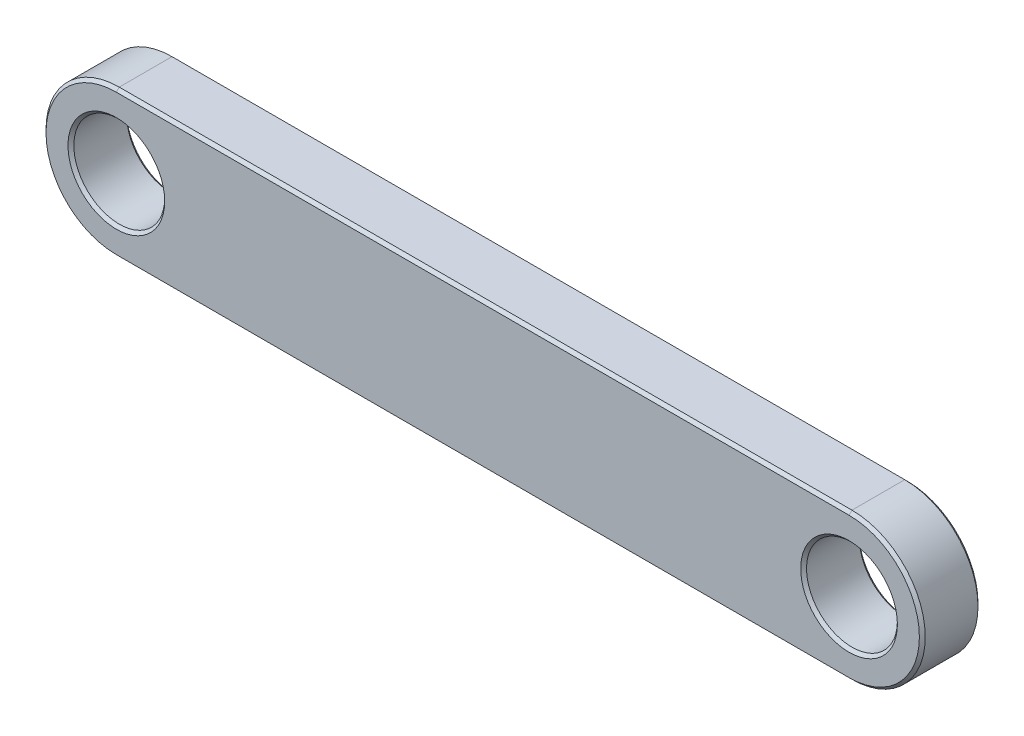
ISO-10303-21;
HEADER;
FILE_DESCRIPTION(('STEP AP214'),'2;1');
FILE_NAME('part.step','',(''),(''),'','','');
FILE_SCHEMA(('AUTOMOTIVE_DESIGN { 1 0 10303 214 1 1 1 1 }'));
ENDSEC;
DATA;
#1=APPLICATION_CONTEXT('core data for automotive mechanical design processes');
#2=APPLICATION_PROTOCOL_DEFINITION('international standard','automotive_design',2000,#1);
#3=PRODUCT_CONTEXT('',#1,'mechanical');
#4=PRODUCT('Part','Part','',(#3));
#5=PRODUCT_RELATED_PRODUCT_CATEGORY('part','',(#4));
#6=PRODUCT_DEFINITION_FORMATION('','',#4);
#7=PRODUCT_DEFINITION_CONTEXT('part definition',#1,'design');
#8=PRODUCT_DEFINITION('design','',#6,#7);
#9=PRODUCT_DEFINITION_SHAPE('','',#8);
#10=(LENGTH_UNIT() NAMED_UNIT(*) SI_UNIT(.MILLI.,.METRE.));
#11=(NAMED_UNIT(*) PLANE_ANGLE_UNIT() SI_UNIT($,.RADIAN.));
#12=(NAMED_UNIT(*) SI_UNIT($,.STERADIAN.) SOLID_ANGLE_UNIT());
#13=UNCERTAINTY_MEASURE_WITH_UNIT(LENGTH_MEASURE(1.E-05),#10,'distance_accuracy_value','');
#14=(GEOMETRIC_REPRESENTATION_CONTEXT(3) GLOBAL_UNCERTAINTY_ASSIGNED_CONTEXT((#13)) GLOBAL_UNIT_ASSIGNED_CONTEXT((#10,
#11,#12)) REPRESENTATION_CONTEXT('',''));
#15=CARTESIAN_POINT('',(0.,0.,0.));
#16=DIRECTION('',(0.,0.,1.));
#17=DIRECTION('',(1.,0.,0.));
#18=AXIS2_PLACEMENT_3D('',#15,#16,#17);
#19=CARTESIAN_POINT('',(12.5,0.,2.));
#20=DIRECTION('',(0.,0.,1.));
#21=DIRECTION('',(1.,0.,0.));
#22=AXIS2_PLACEMENT_3D('',#19,#20,#21);
#23=PLANE('',#22);
#24=CARTESIAN_POINT('',(12.5,0.,2.));
#25=DIRECTION('',(0.,0.,1.));
#26=DIRECTION('',(1.,0.,0.));
#27=AXIS2_PLACEMENT_3D('',#24,#25,#26);
#28=CIRCLE('',#27,1.65);
#29=CARTESIAN_POINT('',(14.15,0.,2.));
#30=VERTEX_POINT('',#29);
#31=EDGE_CURVE('E11',#30,#30,#28,.F.);
#32=ORIENTED_EDGE('',*,*,#31,.T.);
#33=EDGE_LOOP('',(#32));
#34=FACE_BOUND('',#33,.T.);
#35=CARTESIAN_POINT('',(-12.5,0.,2.));
#36=DIRECTION('',(0.,0.,1.));
#37=DIRECTION('',(1.,0.,0.));
#38=AXIS2_PLACEMENT_3D('',#35,#36,#37);
#39=CIRCLE('',#38,2.39999999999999);
#40=CARTESIAN_POINT('',(-12.5,2.4,2.));
#41=VERTEX_POINT('',#40);
#42=CARTESIAN_POINT('',(-12.5,-2.39999999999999,2.));
#43=VERTEX_POINT('',#42);
#44=EDGE_CURVE('E53',#41,#43,#39,.T.);
#45=ORIENTED_EDGE('',*,*,#44,.T.);
#46=DIRECTION('',(1.,0.,0.));
#47=VECTOR('',#46,1.);
#48=CARTESIAN_POINT('',(12.5,-2.39999999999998,2.));
#49=LINE('',#48,#47);
#50=CARTESIAN_POINT('',(12.5,-2.39999999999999,2.));
#51=VERTEX_POINT('',#50);
#52=EDGE_CURVE('E45',#43,#51,#49,.T.);
#53=ORIENTED_EDGE('',*,*,#52,.T.);
#54=CARTESIAN_POINT('',(12.5,0.,2.));
#55=DIRECTION('',(0.,0.,1.));
#56=DIRECTION('',(1.,0.,0.));
#57=AXIS2_PLACEMENT_3D('',#54,#55,#56);
#58=CIRCLE('',#57,2.39999999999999);
#59=CARTESIAN_POINT('',(12.5,2.39999999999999,2.));
#60=VERTEX_POINT('',#59);
#61=EDGE_CURVE('E171',#51,#60,#58,.T.);
#62=ORIENTED_EDGE('',*,*,#61,.T.);
#63=DIRECTION('',(-1.,0.,0.));
#64=VECTOR('',#63,1.);
#65=CARTESIAN_POINT('',(-12.5,2.4,2.));
#66=LINE('',#65,#64);
#67=EDGE_CURVE('E58',#60,#41,#66,.T.);
#68=ORIENTED_EDGE('',*,*,#67,.T.);
#69=EDGE_LOOP('',(#45,#53,#62,#68));
#70=FACE_BOUND('',#69,.T.);
#71=CARTESIAN_POINT('',(-12.5,0.,2.));
#72=DIRECTION('',(0.,0.,1.));
#73=DIRECTION('',(1.,0.,0.));
#74=AXIS2_PLACEMENT_3D('',#71,#72,#73);
#75=CIRCLE('',#74,1.65);
#76=CARTESIAN_POINT('',(-10.85,0.,2.));
#77=VERTEX_POINT('',#76);
#78=EDGE_CURVE('E168',#77,#77,#75,.F.);
#79=ORIENTED_EDGE('',*,*,#78,.T.);
#80=EDGE_LOOP('',(#79));
#81=FACE_BOUND('',#80,.T.);
#82=ADVANCED_FACE('F35',(#34,#70,#81),#23,.T.);
#83=CARTESIAN_POINT('',(12.5,0.,0.));
#84=DIRECTION('',(0.,0.,1.));
#85=DIRECTION('',(1.,0.,0.));
#86=AXIS2_PLACEMENT_3D('',#83,#84,#85);
#87=PLANE('',#86);
#88=CARTESIAN_POINT('',(12.5,0.,0.));
#89=DIRECTION('',(0.,0.,1.));
#90=DIRECTION('',(1.,0.,0.));
#91=AXIS2_PLACEMENT_3D('',#88,#89,#90);
#92=CIRCLE('',#91,1.65);
#93=CARTESIAN_POINT('',(14.15,0.,0.));
#94=VERTEX_POINT('',#93);
#95=EDGE_CURVE('E133',#94,#94,#92,.T.);
#96=ORIENTED_EDGE('',*,*,#95,.T.);
#97=EDGE_LOOP('',(#96));
#98=FACE_BOUND('',#97,.T.);
#99=CARTESIAN_POINT('',(-12.5,0.,0.));
#100=DIRECTION('',(0.,0.,1.));
#101=DIRECTION('',(1.,0.,0.));
#102=AXIS2_PLACEMENT_3D('',#99,#100,#101);
#103=CIRCLE('',#102,1.65);
#104=CARTESIAN_POINT('',(-10.85,0.,0.));
#105=VERTEX_POINT('',#104);
#106=EDGE_CURVE('E130',#105,#105,#103,.T.);
#107=ORIENTED_EDGE('',*,*,#106,.T.);
#108=EDGE_LOOP('',(#107));
#109=FACE_BOUND('',#108,.T.);
#110=CARTESIAN_POINT('',(-12.5,0.,0.));
#111=DIRECTION('',(0.,0.,1.));
#112=DIRECTION('',(1.,0.,0.));
#113=AXIS2_PLACEMENT_3D('',#110,#111,#112);
#114=CIRCLE('',#113,2.40000000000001);
#115=CARTESIAN_POINT('',(-12.5,-2.4,0.));
#116=VERTEX_POINT('',#115);
#117=CARTESIAN_POINT('',(-12.5,2.40000000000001,0.));
#118=VERTEX_POINT('',#117);
#119=EDGE_CURVE('E129',#116,#118,#114,.F.);
#120=ORIENTED_EDGE('',*,*,#119,.T.);
#121=DIRECTION('',(1.,0.,0.));
#122=VECTOR('',#121,1.);
#123=CARTESIAN_POINT('',(12.5,2.40000000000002,0.));
#124=LINE('',#123,#122);
#125=CARTESIAN_POINT('',(12.5,2.40000000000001,0.));
#126=VERTEX_POINT('',#125);
#127=EDGE_CURVE('E108',#118,#126,#124,.T.);
#128=ORIENTED_EDGE('',*,*,#127,.T.);
#129=CARTESIAN_POINT('',(12.5,0.,0.));
#130=DIRECTION('',(0.,0.,1.));
#131=DIRECTION('',(1.,0.,0.));
#132=AXIS2_PLACEMENT_3D('',#129,#130,#131);
#133=CIRCLE('',#132,2.40000000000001);
#134=CARTESIAN_POINT('',(12.5,-2.40000000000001,0.));
#135=VERTEX_POINT('',#134);
#136=EDGE_CURVE('E118',#126,#135,#133,.F.);
#137=ORIENTED_EDGE('',*,*,#136,.T.);
#138=DIRECTION('',(-1.,0.,0.));
#139=VECTOR('',#138,1.);
#140=CARTESIAN_POINT('',(12.5,-2.4,0.));
#141=LINE('',#140,#139);
#142=EDGE_CURVE('E124',#135,#116,#141,.T.);
#143=ORIENTED_EDGE('',*,*,#142,.T.);
#144=EDGE_LOOP('',(#120,#128,#137,#143));
#145=FACE_BOUND('',#144,.T.);
#146=ADVANCED_FACE('F127',(#98,#109,#145),#87,.F.);
#147=CARTESIAN_POINT('',(12.5,0.,2.));
#148=DIRECTION('',(0.,0.,-1.));
#149=DIRECTION('',(-1.,0.,0.));
#150=AXIS2_PLACEMENT_3D('',#147,#148,#149);
#151=CYLINDRICAL_SURFACE('',#150,2.5);
#152=DIRECTION('',(0.,0.,-1.));
#153=VECTOR('',#152,1.);
#154=CARTESIAN_POINT('',(12.5,-2.49999999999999,2.));
#155=LINE('',#154,#153);
#156=CARTESIAN_POINT('',(12.5,-2.49999999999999,1.89999999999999));
#157=VERTEX_POINT('',#156);
#158=CARTESIAN_POINT('',(12.5,-2.49999999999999,0.099999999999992));
#159=VERTEX_POINT('',#158);
#160=EDGE_CURVE('E180',#157,#159,#155,.T.);
#161=ORIENTED_EDGE('',*,*,#160,.T.);
#162=CARTESIAN_POINT('',(12.5,0.,0.099999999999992));
#163=DIRECTION('',(0.,0.,1.));
#164=DIRECTION('',(1.,0.,0.));
#165=AXIS2_PLACEMENT_3D('',#162,#163,#164);
#166=CIRCLE('',#165,2.5);
#167=CARTESIAN_POINT('',(12.5,2.50000000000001,0.099999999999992));
#168=VERTEX_POINT('',#167);
#169=EDGE_CURVE('E166',#159,#168,#166,.T.);
#170=ORIENTED_EDGE('',*,*,#169,.T.);
#171=DIRECTION('',(0.,0.,-1.));
#172=VECTOR('',#171,1.);
#173=CARTESIAN_POINT('',(12.5,2.50000000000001,2.));
#174=LINE('',#173,#172);
#175=CARTESIAN_POINT('',(12.5,2.50000000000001,1.89999999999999));
#176=VERTEX_POINT('',#175);
#177=EDGE_CURVE('E125',#176,#168,#174,.T.);
#178=ORIENTED_EDGE('',*,*,#177,.F.);
#179=CARTESIAN_POINT('',(12.5,0.,1.89999999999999));
#180=DIRECTION('',(0.,0.,1.));
#181=DIRECTION('',(1.,0.,0.));
#182=AXIS2_PLACEMENT_3D('',#179,#180,#181);
#183=CIRCLE('',#182,2.5);
#184=EDGE_CURVE('E164',#176,#157,#183,.F.);
#185=ORIENTED_EDGE('',*,*,#184,.T.);
#186=EDGE_LOOP('',(#161,#170,#178,#185));
#187=FACE_BOUND('',#186,.T.);
#188=ADVANCED_FACE('F206',(#187),#151,.T.);
#189=CARTESIAN_POINT('',(12.5,2.50000000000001,2.));
#190=DIRECTION('',(0.,-1.,0.));
#191=DIRECTION('',(1.,0.,0.));
#192=AXIS2_PLACEMENT_3D('',#189,#190,#191);
#193=PLANE('',#192);
#194=ORIENTED_EDGE('',*,*,#177,.T.);
#195=DIRECTION('',(-1.,0.,0.));
#196=VECTOR('',#195,1.);
#197=CARTESIAN_POINT('',(12.5,2.50000000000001,0.099999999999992));
#198=LINE('',#197,#196);
#199=CARTESIAN_POINT('',(-12.5,2.5,0.099999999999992));
#200=VERTEX_POINT('',#199);
#201=EDGE_CURVE('E111',#168,#200,#198,.T.);
#202=ORIENTED_EDGE('',*,*,#201,.T.);
#203=DIRECTION('',(0.,0.,-1.));
#204=VECTOR('',#203,1.);
#205=CARTESIAN_POINT('',(-12.5,2.5,2.));
#206=LINE('',#205,#204);
#207=CARTESIAN_POINT('',(-12.5,2.5,1.89999999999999));
#208=VERTEX_POINT('',#207);
#209=EDGE_CURVE('E203',#208,#200,#206,.T.);
#210=ORIENTED_EDGE('',*,*,#209,.F.);
#211=DIRECTION('',(1.,0.,0.));
#212=VECTOR('',#211,1.);
#213=CARTESIAN_POINT('',(12.5,2.50000000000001,1.89999999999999));
#214=LINE('',#213,#212);
#215=EDGE_CURVE('E152',#208,#176,#214,.T.);
#216=ORIENTED_EDGE('',*,*,#215,.T.);
#217=EDGE_LOOP('',(#194,#202,#210,#216));
#218=FACE_BOUND('',#217,.T.);
#219=ADVANCED_FACE('F201',(#218),#193,.F.);
#220=CARTESIAN_POINT('',(-12.5,0.,2.));
#221=DIRECTION('',(0.,0.,-1.));
#222=DIRECTION('',(-1.,0.,0.));
#223=AXIS2_PLACEMENT_3D('',#220,#221,#222);
#224=CYLINDRICAL_SURFACE('',#223,2.5);
#225=ORIENTED_EDGE('',*,*,#209,.T.);
#226=CARTESIAN_POINT('',(-12.5,0.,0.099999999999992));
#227=DIRECTION('',(0.,0.,1.));
#228=DIRECTION('',(1.,0.,0.));
#229=AXIS2_PLACEMENT_3D('',#226,#227,#228);
#230=CIRCLE('',#229,2.5);
#231=CARTESIAN_POINT('',(-12.5,-2.5,0.099999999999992));
#232=VERTEX_POINT('',#231);
#233=EDGE_CURVE('E157',#200,#232,#230,.T.);
#234=ORIENTED_EDGE('',*,*,#233,.T.);
#235=DIRECTION('',(0.,0.,-1.));
#236=VECTOR('',#235,1.);
#237=CARTESIAN_POINT('',(-12.5,-2.5,2.));
#238=LINE('',#237,#236);
#239=CARTESIAN_POINT('',(-12.5,-2.5,1.89999999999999));
#240=VERTEX_POINT('',#239);
#241=EDGE_CURVE('E209',#240,#232,#238,.T.);
#242=ORIENTED_EDGE('',*,*,#241,.F.);
#243=CARTESIAN_POINT('',(-12.5,0.,1.89999999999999));
#244=DIRECTION('',(0.,0.,1.));
#245=DIRECTION('',(1.,0.,0.));
#246=AXIS2_PLACEMENT_3D('',#243,#244,#245);
#247=CIRCLE('',#246,2.5);
#248=EDGE_CURVE('E155',#240,#208,#247,.F.);
#249=ORIENTED_EDGE('',*,*,#248,.T.);
#250=EDGE_LOOP('',(#225,#234,#242,#249));
#251=FACE_BOUND('',#250,.T.);
#252=ADVANCED_FACE('F222',(#251),#224,.T.);
#253=CARTESIAN_POINT('',(12.5,-2.49999999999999,2.));
#254=DIRECTION('',(0.,1.,0.));
#255=DIRECTION('',(-1.,0.,0.));
#256=AXIS2_PLACEMENT_3D('',#253,#254,#255);
#257=PLANE('',#256);
#258=ORIENTED_EDGE('',*,*,#241,.T.);
#259=DIRECTION('',(1.,0.,0.));
#260=VECTOR('',#259,1.);
#261=CARTESIAN_POINT('',(12.5,-2.49999999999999,0.099999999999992));
#262=LINE('',#261,#260);
#263=EDGE_CURVE('E162',#232,#159,#262,.T.);
#264=ORIENTED_EDGE('',*,*,#263,.T.);
#265=ORIENTED_EDGE('',*,*,#160,.F.);
#266=DIRECTION('',(-1.,0.,0.));
#267=VECTOR('',#266,1.);
#268=CARTESIAN_POINT('',(-12.5,-2.5,1.89999999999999));
#269=LINE('',#268,#267);
#270=EDGE_CURVE('E159',#157,#240,#269,.T.);
#271=ORIENTED_EDGE('',*,*,#270,.T.);
#272=EDGE_LOOP('',(#258,#264,#265,#271));
#273=FACE_BOUND('',#272,.T.);
#274=ADVANCED_FACE('F226',(#273),#257,.F.);
#275=CARTESIAN_POINT('',(-12.5,0.,2.));
#276=DIRECTION('',(0.,0.,-1.));
#277=DIRECTION('',(-1.,0.,0.));
#278=AXIS2_PLACEMENT_3D('',#275,#276,#277);
#279=CYLINDRICAL_SURFACE('',#278,1.55);
#280=CARTESIAN_POINT('',(-12.5,0.,0.0999999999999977));
#281=DIRECTION('',(0.,0.,1.));
#282=DIRECTION('',(1.,0.,0.));
#283=AXIS2_PLACEMENT_3D('',#280,#281,#282);
#284=CIRCLE('',#283,1.55);
#285=CARTESIAN_POINT('',(-10.95,0.,0.0999999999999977));
#286=VERTEX_POINT('',#285);
#287=EDGE_CURVE('E149',#286,#286,#284,.F.);
#288=ORIENTED_EDGE('',*,*,#287,.T.);
#289=EDGE_LOOP('',(#288));
#290=FACE_BOUND('',#289,.T.);
#291=CARTESIAN_POINT('',(-12.5,0.,1.9));
#292=DIRECTION('',(0.,0.,1.));
#293=DIRECTION('',(1.,0.,0.));
#294=AXIS2_PLACEMENT_3D('',#291,#292,#293);
#295=CIRCLE('',#294,1.55);
#296=CARTESIAN_POINT('',(-10.95,0.,1.9));
#297=VERTEX_POINT('',#296);
#298=EDGE_CURVE('E146',#297,#297,#295,.T.);
#299=ORIENTED_EDGE('',*,*,#298,.T.);
#300=EDGE_LOOP('',(#299));
#301=FACE_BOUND('',#300,.T.);
#302=ADVANCED_FACE('F242',(#290,#301),#279,.F.);
#303=CARTESIAN_POINT('',(12.5,0.,2.));
#304=DIRECTION('',(0.,0.,-1.));
#305=DIRECTION('',(-1.,0.,0.));
#306=AXIS2_PLACEMENT_3D('',#303,#304,#305);
#307=CYLINDRICAL_SURFACE('',#306,1.55);
#308=CARTESIAN_POINT('',(12.5,0.,0.100000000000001));
#309=DIRECTION('',(0.,0.,1.));
#310=DIRECTION('',(1.,0.,0.));
#311=AXIS2_PLACEMENT_3D('',#308,#309,#310);
#312=CIRCLE('',#311,1.55);
#313=CARTESIAN_POINT('',(14.05,0.,0.100000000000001));
#314=VERTEX_POINT('',#313);
#315=EDGE_CURVE('E143',#314,#314,#312,.F.);
#316=ORIENTED_EDGE('',*,*,#315,.T.);
#317=EDGE_LOOP('',(#316));
#318=FACE_BOUND('',#317,.T.);
#319=CARTESIAN_POINT('',(12.5,0.,1.9));
#320=DIRECTION('',(0.,0.,1.));
#321=DIRECTION('',(1.,0.,0.));
#322=AXIS2_PLACEMENT_3D('',#319,#320,#321);
#323=CIRCLE('',#322,1.55);
#324=CARTESIAN_POINT('',(14.05,0.,1.9));
#325=VERTEX_POINT('',#324);
#326=EDGE_CURVE('E140',#325,#325,#323,.T.);
#327=ORIENTED_EDGE('',*,*,#326,.T.);
#328=EDGE_LOOP('',(#327));
#329=FACE_BOUND('',#328,.T.);
#330=ADVANCED_FACE('F244',(#318,#329),#307,.F.);
#331=CARTESIAN_POINT('',(12.5,0.,0.));
#332=DIRECTION('',(0.,0.,-1.));
#333=DIRECTION('',(-1.,0.,0.));
#334=AXIS2_PLACEMENT_3D('',#331,#332,#333);
#335=CONICAL_SURFACE('',#334,1.65,0.785398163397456);
#336=ORIENTED_EDGE('',*,*,#315,.F.);
#337=EDGE_LOOP('',(#336));
#338=FACE_BOUND('',#337,.T.);
#339=ORIENTED_EDGE('',*,*,#95,.F.);
#340=EDGE_LOOP('',(#339));
#341=FACE_BOUND('',#340,.T.);
#342=ADVANCED_FACE('F251',(#338,#341),#335,.F.);
#343=CARTESIAN_POINT('',(-12.5,0.,0.));
#344=DIRECTION('',(0.,0.,-1.));
#345=DIRECTION('',(-1.,0.,0.));
#346=AXIS2_PLACEMENT_3D('',#343,#344,#345);
#347=CONICAL_SURFACE('',#346,1.65,0.785398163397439);
#348=ORIENTED_EDGE('',*,*,#287,.F.);
#349=EDGE_LOOP('',(#348));
#350=FACE_BOUND('',#349,.T.);
#351=ORIENTED_EDGE('',*,*,#106,.F.);
#352=EDGE_LOOP('',(#351));
#353=FACE_BOUND('',#352,.T.);
#354=ADVANCED_FACE('F271',(#350,#353),#347,.F.);
#355=CARTESIAN_POINT('',(12.5,-2.49999999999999,0.099999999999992));
#356=DIRECTION('',(0.,0.707106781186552,0.707106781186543));
#357=DIRECTION('',(1.,0.,0.));
#358=AXIS2_PLACEMENT_3D('',#355,#356,#357);
#359=PLANE('',#358);
#360=DIRECTION('',(0.,-0.707106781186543,0.707106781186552));
#361=VECTOR('',#360,1.);
#362=CARTESIAN_POINT('',(-12.5,-2.4,0.));
#363=LINE('',#362,#361);
#364=EDGE_CURVE('E114',#116,#232,#363,.T.);
#365=ORIENTED_EDGE('',*,*,#364,.F.);
#366=ORIENTED_EDGE('',*,*,#142,.F.);
#367=DIRECTION('',(0.,0.707106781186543,-0.707106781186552));
#368=VECTOR('',#367,1.);
#369=CARTESIAN_POINT('',(12.5,-2.49999999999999,0.099999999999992));
#370=LINE('',#369,#368);
#371=EDGE_CURVE('E121',#159,#135,#370,.T.);
#372=ORIENTED_EDGE('',*,*,#371,.F.);
#373=ORIENTED_EDGE('',*,*,#263,.F.);
#374=EDGE_LOOP('',(#365,#366,#372,#373));
#375=FACE_BOUND('',#374,.T.);
#376=ADVANCED_FACE('F215',(#375),#359,.F.);
#377=CARTESIAN_POINT('',(12.5,0.,0.099999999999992));
#378=DIRECTION('',(0.,0.,1.));
#379=DIRECTION('',(1.,0.,0.));
#380=AXIS2_PLACEMENT_3D('',#377,#378,#379);
#381=CONICAL_SURFACE('',#380,2.5,0.785398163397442);
#382=ORIENTED_EDGE('',*,*,#371,.T.);
#383=ORIENTED_EDGE('',*,*,#136,.F.);
#384=DIRECTION('',(0.,-0.707106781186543,-0.707106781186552));
#385=VECTOR('',#384,1.);
#386=CARTESIAN_POINT('',(12.5,2.5,0.099999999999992));
#387=LINE('',#386,#385);
#388=EDGE_CURVE('E104',#168,#126,#387,.T.);
#389=ORIENTED_EDGE('',*,*,#388,.F.);
#390=ORIENTED_EDGE('',*,*,#169,.F.);
#391=EDGE_LOOP('',(#382,#383,#389,#390));
#392=FACE_BOUND('',#391,.T.);
#393=ADVANCED_FACE('F119',(#392),#381,.T.);
#394=CARTESIAN_POINT('',(-12.5,0.,0.099999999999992));
#395=DIRECTION('',(0.,0.,1.));
#396=DIRECTION('',(1.,0.,0.));
#397=AXIS2_PLACEMENT_3D('',#394,#395,#396);
#398=CONICAL_SURFACE('',#397,2.5,0.785398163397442);
#399=ORIENTED_EDGE('',*,*,#364,.T.);
#400=ORIENTED_EDGE('',*,*,#233,.F.);
#401=DIRECTION('',(0.,0.707106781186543,0.707106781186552));
#402=VECTOR('',#401,1.);
#403=CARTESIAN_POINT('',(-12.5,2.40000000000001,0.));
#404=LINE('',#403,#402);
#405=EDGE_CURVE('E115',#118,#200,#404,.T.);
#406=ORIENTED_EDGE('',*,*,#405,.F.);
#407=ORIENTED_EDGE('',*,*,#119,.F.);
#408=EDGE_LOOP('',(#399,#400,#406,#407));
#409=FACE_BOUND('',#408,.T.);
#410=ADVANCED_FACE('F218',(#409),#398,.T.);
#411=CARTESIAN_POINT('',(12.5,2.50000000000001,0.099999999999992));
#412=DIRECTION('',(0.,-0.707106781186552,0.707106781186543));
#413=DIRECTION('',(-1.,0.,0.));
#414=AXIS2_PLACEMENT_3D('',#411,#412,#413);
#415=PLANE('',#414);
#416=ORIENTED_EDGE('',*,*,#388,.T.);
#417=ORIENTED_EDGE('',*,*,#127,.F.);
#418=ORIENTED_EDGE('',*,*,#405,.T.);
#419=ORIENTED_EDGE('',*,*,#201,.F.);
#420=EDGE_LOOP('',(#416,#417,#418,#419));
#421=FACE_BOUND('',#420,.T.);
#422=ADVANCED_FACE('F106',(#421),#415,.F.);
#423=CARTESIAN_POINT('',(12.5,0.,1.9));
#424=DIRECTION('',(0.,0.,1.));
#425=DIRECTION('',(1.,0.,0.));
#426=AXIS2_PLACEMENT_3D('',#423,#424,#425);
#427=CONICAL_SURFACE('',#426,1.55,0.785398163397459);
#428=CARTESIAN_POINT('',(14.15,0.,2.));
#429=CARTESIAN_POINT('',(14.1489583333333,0.,1.99895833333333));
#430=CARTESIAN_POINT('',(14.1479166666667,0.,1.99791666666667));
#431=CARTESIAN_POINT('',(14.1458333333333,0.,1.99583333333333));
#432=CARTESIAN_POINT('',(14.1447916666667,0.,1.99479166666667));
#433=CARTESIAN_POINT('',(14.1427083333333,0.,1.99270833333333));
#434=CARTESIAN_POINT('',(14.1416666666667,0.,1.99166666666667));
#435=CARTESIAN_POINT('',(14.1395833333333,0.,1.98958333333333));
#436=CARTESIAN_POINT('',(14.1385416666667,0.,1.98854166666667));
#437=CARTESIAN_POINT('',(14.1364583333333,0.,1.98645833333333));
#438=CARTESIAN_POINT('',(14.1354166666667,0.,1.98541666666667));
#439=CARTESIAN_POINT('',(14.1333333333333,0.,1.98333333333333));
#440=CARTESIAN_POINT('',(14.1322916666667,0.,1.98229166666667));
#441=CARTESIAN_POINT('',(14.1302083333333,0.,1.98020833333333));
#442=CARTESIAN_POINT('',(14.1291666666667,0.,1.97916666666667));
#443=CARTESIAN_POINT('',(14.1270833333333,0.,1.97708333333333));
#444=CARTESIAN_POINT('',(14.1260416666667,0.,1.97604166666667));
#445=CARTESIAN_POINT('',(14.1239583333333,0.,1.97395833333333));
#446=CARTESIAN_POINT('',(14.1229166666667,0.,1.97291666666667));
#447=CARTESIAN_POINT('',(14.1208333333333,0.,1.97083333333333));
#448=CARTESIAN_POINT('',(14.1197916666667,0.,1.96979166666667));
#449=CARTESIAN_POINT('',(14.1177083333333,0.,1.96770833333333));
#450=CARTESIAN_POINT('',(14.1166666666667,0.,1.96666666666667));
#451=CARTESIAN_POINT('',(14.1145833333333,0.,1.96458333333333));
#452=CARTESIAN_POINT('',(14.1135416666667,0.,1.96354166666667));
#453=CARTESIAN_POINT('',(14.1114583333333,0.,1.96145833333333));
#454=CARTESIAN_POINT('',(14.1104166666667,0.,1.96041666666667));
#455=CARTESIAN_POINT('',(14.1083333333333,0.,1.95833333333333));
#456=CARTESIAN_POINT('',(14.1072916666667,0.,1.95729166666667));
#457=CARTESIAN_POINT('',(14.1052083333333,0.,1.95520833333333));
#458=CARTESIAN_POINT('',(14.1041666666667,0.,1.95416666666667));
#459=CARTESIAN_POINT('',(14.1020833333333,0.,1.95208333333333));
#460=CARTESIAN_POINT('',(14.1010416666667,0.,1.95104166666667));
#461=CARTESIAN_POINT('',(14.0989583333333,0.,1.94895833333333));
#462=CARTESIAN_POINT('',(14.0979166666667,0.,1.94791666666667));
#463=CARTESIAN_POINT('',(14.0958333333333,0.,1.94583333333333));
#464=CARTESIAN_POINT('',(14.0947916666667,0.,1.94479166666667));
#465=CARTESIAN_POINT('',(14.0927083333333,0.,1.94270833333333));
#466=CARTESIAN_POINT('',(14.0916666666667,0.,1.94166666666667));
#467=CARTESIAN_POINT('',(14.0895833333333,0.,1.93958333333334));
#468=CARTESIAN_POINT('',(14.0885416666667,0.,1.93854166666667));
#469=CARTESIAN_POINT('',(14.0864583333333,0.,1.93645833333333));
#470=CARTESIAN_POINT('',(14.0854166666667,0.,1.93541666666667));
#471=CARTESIAN_POINT('',(14.0833333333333,0.,1.93333333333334));
#472=CARTESIAN_POINT('',(14.0822916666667,0.,1.93229166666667));
#473=CARTESIAN_POINT('',(14.0802083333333,0.,1.93020833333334));
#474=CARTESIAN_POINT('',(14.0791666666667,0.,1.92916666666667));
#475=CARTESIAN_POINT('',(14.0770833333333,0.,1.92708333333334));
#476=CARTESIAN_POINT('',(14.0760416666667,0.,1.92604166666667));
#477=CARTESIAN_POINT('',(14.0739583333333,0.,1.92395833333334));
#478=CARTESIAN_POINT('',(14.0729166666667,0.,1.92291666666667));
#479=CARTESIAN_POINT('',(14.0708333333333,0.,1.92083333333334));
#480=CARTESIAN_POINT('',(14.0697916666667,0.,1.91979166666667));
#481=CARTESIAN_POINT('',(14.0677083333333,0.,1.91770833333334));
#482=CARTESIAN_POINT('',(14.0666666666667,0.,1.91666666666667));
#483=CARTESIAN_POINT('',(14.0645833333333,0.,1.91458333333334));
#484=CARTESIAN_POINT('',(14.0635416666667,0.,1.91354166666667));
#485=CARTESIAN_POINT('',(14.0614583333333,0.,1.91145833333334));
#486=CARTESIAN_POINT('',(14.0604166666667,0.,1.91041666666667));
#487=CARTESIAN_POINT('',(14.0583333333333,0.,1.90833333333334));
#488=CARTESIAN_POINT('',(14.0572916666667,0.,1.90729166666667));
#489=CARTESIAN_POINT('',(14.0552083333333,0.,1.90520833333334));
#490=CARTESIAN_POINT('',(14.0541666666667,0.,1.90416666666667));
#491=CARTESIAN_POINT('',(14.0520833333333,0.,1.90208333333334));
#492=CARTESIAN_POINT('',(14.0510416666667,0.,1.90104166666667));
#493=CARTESIAN_POINT('',(14.05,0.,1.9));
#494=B_SPLINE_CURVE_WITH_KNOTS('',3,(#428,#429,#430,#431,#432,#433,#434,#435,#436,#437,#438,
#439,#440,#441,#442,#443,#444,#445,#446,#447,#448,#449,#450,#451,#452,#453,#454,#455,#456,#457,
#458,#459,#460,#461,#462,#463,#464,#465,#466,#467,#468,#469,#470,#471,#472,#473,#474,#475,#476,
#477,#478,#479,#480,#481,#482,#483,#484,#485,#486,#487,#488,#489,#490,#491,#492,#493),
.UNSPECIFIED.,.F.,.F.,(4,2,2,2,2,2,2,2,2,2,2,2,2,2,2,2,2,2,2,2,2,2,2,2,2,2,2,2,2,2,2,2,4),(0.,
0.00441941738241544,0.00883883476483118,0.0132582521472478,0.0176776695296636,0.022097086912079,
0.0265165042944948,0.0309359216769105,0.0353553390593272,0.0397747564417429,0.0441941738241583,
0.0486135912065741,0.0530330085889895,0.0574524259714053,0.0618718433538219,0.0662912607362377,
0.0707106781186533,0.0751300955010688,0.0795495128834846,0.0839689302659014,0.088388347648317,
0.0928077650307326,0.0972271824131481,0.101646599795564,0.106066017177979,0.110485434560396,
0.114904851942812,0.119324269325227,0.123743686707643,0.128163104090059,0.132582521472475,
0.137001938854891,0.141421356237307),.UNSPECIFIED.);
#495=EDGE_CURVE('BSEAM286',#30,#325,#494,.T.);
#496=ORIENTED_EDGE('',*,*,#31,.F.);
#497=ORIENTED_EDGE('',*,*,#326,.F.);
#498=ORIENTED_EDGE('',*,*,#495,.T.);
#499=ORIENTED_EDGE('',*,*,#495,.F.);
#500=EDGE_LOOP('',(#496,#498,#497,#499));
#501=FACE_BOUND('',#500,.T.);
#502=ADVANCED_FACE('F286',(#501),#427,.F.);
#503=CARTESIAN_POINT('',(12.5,2.4,2.));
#504=DIRECTION('',(0.,0.70710678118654,0.707106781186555));
#505=DIRECTION('',(1.,0.,0.));
#506=AXIS2_PLACEMENT_3D('',#503,#504,#505);
#507=PLANE('',#506);
#508=DIRECTION('',(0.,-0.707106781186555,0.70710678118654));
#509=VECTOR('',#508,1.);
#510=CARTESIAN_POINT('',(12.5,2.50000000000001,1.89999999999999));
#511=LINE('',#510,#509);
#512=EDGE_CURVE('E184',#176,#60,#511,.T.);
#513=ORIENTED_EDGE('',*,*,#512,.F.);
#514=ORIENTED_EDGE('',*,*,#215,.F.);
#515=DIRECTION('',(0.,0.707106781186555,-0.70710678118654));
#516=VECTOR('',#515,1.);
#517=CARTESIAN_POINT('',(-12.5,2.4,2.));
#518=LINE('',#517,#516);
#519=EDGE_CURVE('E40',#41,#208,#518,.T.);
#520=ORIENTED_EDGE('',*,*,#519,.F.);
#521=ORIENTED_EDGE('',*,*,#67,.F.);
#522=EDGE_LOOP('',(#513,#514,#520,#521));
#523=FACE_BOUND('',#522,.T.);
#524=ADVANCED_FACE('F196',(#523),#507,.T.);
#525=CARTESIAN_POINT('',(-12.5,0.,2.));
#526=DIRECTION('',(0.,0.,-1.));
#527=DIRECTION('',(-1.,0.,0.));
#528=AXIS2_PLACEMENT_3D('',#525,#526,#527);
#529=CONICAL_SURFACE('',#528,2.39999999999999,0.785398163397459);
#530=ORIENTED_EDGE('',*,*,#519,.T.);
#531=ORIENTED_EDGE('',*,*,#248,.F.);
#532=DIRECTION('',(0.,-0.707106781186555,-0.70710678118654));
#533=VECTOR('',#532,1.);
#534=CARTESIAN_POINT('',(-12.5,-2.39999999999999,2.));
#535=LINE('',#534,#533);
#536=EDGE_CURVE('E183',#43,#240,#535,.T.);
#537=ORIENTED_EDGE('',*,*,#536,.F.);
#538=ORIENTED_EDGE('',*,*,#44,.F.);
#539=EDGE_LOOP('',(#530,#531,#537,#538));
#540=FACE_BOUND('',#539,.T.);
#541=ADVANCED_FACE('F193',(#540),#529,.T.);
#542=CARTESIAN_POINT('',(12.5,0.,2.));
#543=DIRECTION('',(0.,0.,-1.));
#544=DIRECTION('',(-1.,0.,0.));
#545=AXIS2_PLACEMENT_3D('',#542,#543,#544);
#546=CONICAL_SURFACE('',#545,2.39999999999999,0.785398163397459);
#547=ORIENTED_EDGE('',*,*,#512,.T.);
#548=ORIENTED_EDGE('',*,*,#61,.F.);
#549=DIRECTION('',(0.,0.707106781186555,0.70710678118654));
#550=VECTOR('',#549,1.);
#551=CARTESIAN_POINT('',(12.5,-2.5,1.89999999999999));
#552=LINE('',#551,#550);
#553=EDGE_CURVE('E181',#157,#51,#552,.T.);
#554=ORIENTED_EDGE('',*,*,#553,.F.);
#555=ORIENTED_EDGE('',*,*,#184,.F.);
#556=EDGE_LOOP('',(#547,#548,#554,#555));
#557=FACE_BOUND('',#556,.T.);
#558=ADVANCED_FACE('F231',(#557),#546,.T.);
#559=CARTESIAN_POINT('',(12.5,-2.39999999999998,2.));
#560=DIRECTION('',(0.,-0.70710678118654,0.707106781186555));
#561=DIRECTION('',(-1.,0.,0.));
#562=AXIS2_PLACEMENT_3D('',#559,#560,#561);
#563=PLANE('',#562);
#564=ORIENTED_EDGE('',*,*,#536,.T.);
#565=ORIENTED_EDGE('',*,*,#270,.F.);
#566=ORIENTED_EDGE('',*,*,#553,.T.);
#567=ORIENTED_EDGE('',*,*,#52,.F.);
#568=EDGE_LOOP('',(#564,#565,#566,#567));
#569=FACE_BOUND('',#568,.T.);
#570=ADVANCED_FACE('F229',(#569),#563,.T.);
#571=CARTESIAN_POINT('',(-12.5,0.,1.9));
#572=DIRECTION('',(0.,0.,1.));
#573=DIRECTION('',(1.,0.,0.));
#574=AXIS2_PLACEMENT_3D('',#571,#572,#573);
#575=CONICAL_SURFACE('',#574,1.55,0.785398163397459);
#576=CARTESIAN_POINT('',(-10.85,0.,2.));
#577=CARTESIAN_POINT('',(-10.8510416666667,0.,1.99895833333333));
#578=CARTESIAN_POINT('',(-10.8520833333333,0.,1.99791666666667));
#579=CARTESIAN_POINT('',(-10.8541666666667,0.,1.99583333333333));
#580=CARTESIAN_POINT('',(-10.8552083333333,0.,1.99479166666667));
#581=CARTESIAN_POINT('',(-10.8572916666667,0.,1.99270833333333));
#582=CARTESIAN_POINT('',(-10.8583333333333,0.,1.99166666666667));
#583=CARTESIAN_POINT('',(-10.8604166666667,0.,1.98958333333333));
#584=CARTESIAN_POINT('',(-10.8614583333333,0.,1.98854166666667));
#585=CARTESIAN_POINT('',(-10.8635416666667,0.,1.98645833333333));
#586=CARTESIAN_POINT('',(-10.8645833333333,0.,1.98541666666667));
#587=CARTESIAN_POINT('',(-10.8666666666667,0.,1.98333333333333));
#588=CARTESIAN_POINT('',(-10.8677083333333,0.,1.98229166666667));
#589=CARTESIAN_POINT('',(-10.8697916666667,0.,1.98020833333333));
#590=CARTESIAN_POINT('',(-10.8708333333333,0.,1.97916666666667));
#591=CARTESIAN_POINT('',(-10.8729166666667,0.,1.97708333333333));
#592=CARTESIAN_POINT('',(-10.8739583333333,0.,1.97604166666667));
#593=CARTESIAN_POINT('',(-10.8760416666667,0.,1.97395833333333));
#594=CARTESIAN_POINT('',(-10.8770833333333,0.,1.97291666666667));
#595=CARTESIAN_POINT('',(-10.8791666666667,0.,1.97083333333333));
#596=CARTESIAN_POINT('',(-10.8802083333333,0.,1.96979166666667));
#597=CARTESIAN_POINT('',(-10.8822916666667,0.,1.96770833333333));
#598=CARTESIAN_POINT('',(-10.8833333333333,0.,1.96666666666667));
#599=CARTESIAN_POINT('',(-10.8854166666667,0.,1.96458333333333));
#600=CARTESIAN_POINT('',(-10.8864583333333,0.,1.96354166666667));
#601=CARTESIAN_POINT('',(-10.8885416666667,0.,1.96145833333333));
#602=CARTESIAN_POINT('',(-10.8895833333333,0.,1.96041666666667));
#603=CARTESIAN_POINT('',(-10.8916666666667,0.,1.95833333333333));
#604=CARTESIAN_POINT('',(-10.8927083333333,0.,1.95729166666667));
#605=CARTESIAN_POINT('',(-10.8947916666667,0.,1.95520833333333));
#606=CARTESIAN_POINT('',(-10.8958333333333,0.,1.95416666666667));
#607=CARTESIAN_POINT('',(-10.8979166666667,0.,1.95208333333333));
#608=CARTESIAN_POINT('',(-10.8989583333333,0.,1.95104166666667));
#609=CARTESIAN_POINT('',(-10.9010416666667,0.,1.94895833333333));
#610=CARTESIAN_POINT('',(-10.9020833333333,0.,1.94791666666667));
#611=CARTESIAN_POINT('',(-10.9041666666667,0.,1.94583333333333));
#612=CARTESIAN_POINT('',(-10.9052083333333,0.,1.94479166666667));
#613=CARTESIAN_POINT('',(-10.9072916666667,0.,1.94270833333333));
#614=CARTESIAN_POINT('',(-10.9083333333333,0.,1.94166666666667));
#615=CARTESIAN_POINT('',(-10.9104166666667,0.,1.93958333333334));
#616=CARTESIAN_POINT('',(-10.9114583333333,0.,1.93854166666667));
#617=CARTESIAN_POINT('',(-10.9135416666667,0.,1.93645833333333));
#618=CARTESIAN_POINT('',(-10.9145833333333,0.,1.93541666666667));
#619=CARTESIAN_POINT('',(-10.9166666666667,0.,1.93333333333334));
#620=CARTESIAN_POINT('',(-10.9177083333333,0.,1.93229166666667));
#621=CARTESIAN_POINT('',(-10.9197916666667,0.,1.93020833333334));
#622=CARTESIAN_POINT('',(-10.9208333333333,0.,1.92916666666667));
#623=CARTESIAN_POINT('',(-10.9229166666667,0.,1.92708333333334));
#624=CARTESIAN_POINT('',(-10.9239583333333,0.,1.92604166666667));
#625=CARTESIAN_POINT('',(-10.9260416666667,0.,1.92395833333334));
#626=CARTESIAN_POINT('',(-10.9270833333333,0.,1.92291666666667));
#627=CARTESIAN_POINT('',(-10.9291666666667,0.,1.92083333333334));
#628=CARTESIAN_POINT('',(-10.9302083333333,0.,1.91979166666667));
#629=CARTESIAN_POINT('',(-10.9322916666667,0.,1.91770833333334));
#630=CARTESIAN_POINT('',(-10.9333333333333,0.,1.91666666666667));
#631=CARTESIAN_POINT('',(-10.9354166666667,0.,1.91458333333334));
#632=CARTESIAN_POINT('',(-10.9364583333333,0.,1.91354166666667));
#633=CARTESIAN_POINT('',(-10.9385416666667,0.,1.91145833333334));
#634=CARTESIAN_POINT('',(-10.9395833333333,0.,1.91041666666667));
#635=CARTESIAN_POINT('',(-10.9416666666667,0.,1.90833333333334));
#636=CARTESIAN_POINT('',(-10.9427083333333,0.,1.90729166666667));
#637=CARTESIAN_POINT('',(-10.9447916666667,0.,1.90520833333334));
#638=CARTESIAN_POINT('',(-10.9458333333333,0.,1.90416666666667));
#639=CARTESIAN_POINT('',(-10.9479166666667,0.,1.90208333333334));
#640=CARTESIAN_POINT('',(-10.9489583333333,0.,1.90104166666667));
#641=CARTESIAN_POINT('',(-10.95,0.,1.9));
#642=B_SPLINE_CURVE_WITH_KNOTS('',3,(#576,#577,#578,#579,#580,#581,#582,#583,#584,#585,#586,
#587,#588,#589,#590,#591,#592,#593,#594,#595,#596,#597,#598,#599,#600,#601,#602,#603,#604,#605,
#606,#607,#608,#609,#610,#611,#612,#613,#614,#615,#616,#617,#618,#619,#620,#621,#622,#623,#624,
#625,#626,#627,#628,#629,#630,#631,#632,#633,#634,#635,#636,#637,#638,#639,#640,#641),
.UNSPECIFIED.,.F.,.F.,(4,2,2,2,2,2,2,2,2,2,2,2,2,2,2,2,2,2,2,2,2,2,2,2,2,2,2,2,2,2,2,2,4),(0.,
0.00441941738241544,0.00883883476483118,0.0132582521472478,0.0176776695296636,0.022097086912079,
0.0265165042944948,0.0309359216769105,0.0353553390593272,0.0397747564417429,0.0441941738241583,
0.0486135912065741,0.0530330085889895,0.0574524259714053,0.0618718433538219,0.0662912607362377,
0.0707106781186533,0.0751300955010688,0.0795495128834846,0.0839689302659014,0.088388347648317,
0.0928077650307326,0.0972271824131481,0.101646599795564,0.106066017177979,0.110485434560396,
0.114904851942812,0.119324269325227,0.123743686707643,0.128163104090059,0.132582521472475,
0.137001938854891,0.141421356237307),.UNSPECIFIED.);
#643=EDGE_CURVE('BSEAM38',#77,#297,#642,.T.);
#644=ORIENTED_EDGE('',*,*,#78,.F.);
#645=ORIENTED_EDGE('',*,*,#298,.F.);
#646=ORIENTED_EDGE('',*,*,#643,.T.);
#647=ORIENTED_EDGE('',*,*,#643,.F.);
#648=EDGE_LOOP('',(#644,#646,#645,#647));
#649=FACE_BOUND('',#648,.T.);
#650=ADVANCED_FACE('F38',(#649),#575,.F.);
#651=CLOSED_SHELL('',(#82,#146,#188,#219,#252,#274,#302,#330,#342,#354,#376,#393,#410,#422,#502,
#524,#541,#558,#570,#650));
#652=MANIFOLD_SOLID_BREP('B2',#651);
#653=ADVANCED_BREP_SHAPE_REPRESENTATION('',(#18,#652),#14);
#654=SHAPE_DEFINITION_REPRESENTATION(#9,#653);
ENDSEC;
END-ISO-10303-21;
